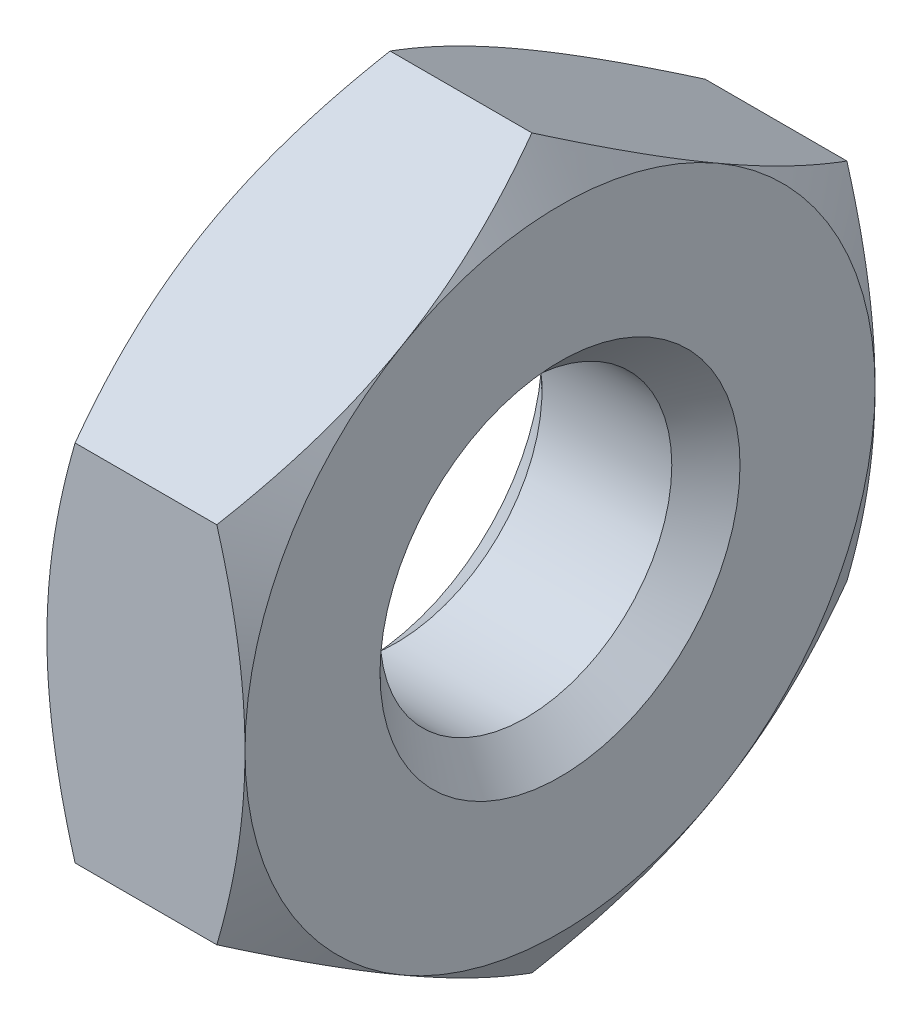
ISO-10303-21;
HEADER;
FILE_DESCRIPTION(('STEP AP214'),'2;1');
FILE_NAME('part.step','',(''),(''),'','','');
FILE_SCHEMA(('AUTOMOTIVE_DESIGN { 1 0 10303 214 1 1 1 1 }'));
ENDSEC;
DATA;
#1=APPLICATION_CONTEXT('core data for automotive mechanical design processes');
#2=APPLICATION_PROTOCOL_DEFINITION('international standard','automotive_design',2000,#1);
#3=PRODUCT_CONTEXT('',#1,'mechanical');
#4=PRODUCT('Part','Part','',(#3));
#5=PRODUCT_RELATED_PRODUCT_CATEGORY('part','',(#4));
#6=PRODUCT_DEFINITION_FORMATION('','',#4);
#7=PRODUCT_DEFINITION_CONTEXT('part definition',#1,'design');
#8=PRODUCT_DEFINITION('design','',#6,#7);
#9=PRODUCT_DEFINITION_SHAPE('','',#8);
#10=(LENGTH_UNIT() NAMED_UNIT(*) SI_UNIT(.MILLI.,.METRE.));
#11=(NAMED_UNIT(*) PLANE_ANGLE_UNIT() SI_UNIT($,.RADIAN.));
#12=(NAMED_UNIT(*) SI_UNIT($,.STERADIAN.) SOLID_ANGLE_UNIT());
#13=UNCERTAINTY_MEASURE_WITH_UNIT(LENGTH_MEASURE(1.E-05),#10,'distance_accuracy_value','');
#14=(GEOMETRIC_REPRESENTATION_CONTEXT(3) GLOBAL_UNCERTAINTY_ASSIGNED_CONTEXT((#13)) GLOBAL_UNIT_ASSIGNED_CONTEXT((#10,
#11,#12)) REPRESENTATION_CONTEXT('',''));
#15=CARTESIAN_POINT('',(0.,0.,0.));
#16=DIRECTION('',(0.,0.,1.));
#17=DIRECTION('',(1.,0.,0.));
#18=AXIS2_PLACEMENT_3D('',#15,#16,#17);
#19=CARTESIAN_POINT('',(1.1,3.5,0.));
#20=DIRECTION('',(-1.,0.,0.));
#21=DIRECTION('',(0.,0.,1.));
#22=AXIS2_PLACEMENT_3D('',#19,#20,#21);
#23=PLANE('',#22);
#24=CARTESIAN_POINT('',(1.10000000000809,0.,0.));
#25=DIRECTION('',(1.,0.,0.));
#26=DIRECTION('',(0.,0.,-1.));
#27=AXIS2_PLACEMENT_3D('',#24,#25,#26);
#28=CIRCLE('',#27,1.99999999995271);
#29=CARTESIAN_POINT('',(1.10000000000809,0.,-1.99999999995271));
#30=VERTEX_POINT('',#29);
#31=EDGE_CURVE('E126',#30,#30,#28,.F.);
#32=ORIENTED_EDGE('',*,*,#31,.T.);
#33=EDGE_LOOP('',(#32));
#34=FACE_BOUND('',#33,.T.);
#35=CARTESIAN_POINT('',(1.0999999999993,0.,0.));
#36=DIRECTION('',(-1.,0.,0.));
#37=DIRECTION('',(0.,0.,1.));
#38=AXIS2_PLACEMENT_3D('',#35,#36,#37);
#39=CIRCLE('',#38,3.50000000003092);
#40=CARTESIAN_POINT('',(1.10000000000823,-3.03108891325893,1.75000000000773));
#41=VERTEX_POINT('',#40);
#42=CARTESIAN_POINT('',(1.10000000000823,0.,3.50000000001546));
#43=VERTEX_POINT('',#42);
#44=EDGE_CURVE('E129',#41,#43,#39,.T.);
#45=ORIENTED_EDGE('',*,*,#44,.F.);
#46=CARTESIAN_POINT('',(1.0999999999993,0.,0.));
#47=DIRECTION('',(-1.,0.,0.));
#48=DIRECTION('',(0.,0.,1.));
#49=AXIS2_PLACEMENT_3D('',#46,#47,#48);
#50=CIRCLE('',#49,3.50000000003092);
#51=CARTESIAN_POINT('',(1.10000000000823,-3.03108891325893,-1.75000000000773));
#52=VERTEX_POINT('',#51);
#53=EDGE_CURVE('E20',#52,#41,#50,.T.);
#54=ORIENTED_EDGE('',*,*,#53,.F.);
#55=CARTESIAN_POINT('',(1.0999999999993,0.,0.));
#56=DIRECTION('',(-1.,0.,0.));
#57=DIRECTION('',(0.,0.,1.));
#58=AXIS2_PLACEMENT_3D('',#55,#56,#57);
#59=CIRCLE('',#58,3.50000000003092);
#60=CARTESIAN_POINT('',(1.10000000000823,0.,-3.50000000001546));
#61=VERTEX_POINT('',#60);
#62=EDGE_CURVE('E104',#61,#52,#59,.T.);
#63=ORIENTED_EDGE('',*,*,#62,.F.);
#64=CARTESIAN_POINT('',(1.0999999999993,0.,0.));
#65=DIRECTION('',(-1.,0.,0.));
#66=DIRECTION('',(0.,0.,1.));
#67=AXIS2_PLACEMENT_3D('',#64,#65,#66);
#68=CIRCLE('',#67,3.50000000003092);
#69=CARTESIAN_POINT('',(1.10000000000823,3.03108891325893,-1.75000000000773));
#70=VERTEX_POINT('',#69);
#71=EDGE_CURVE('E424',#70,#61,#68,.T.);
#72=ORIENTED_EDGE('',*,*,#71,.F.);
#73=CARTESIAN_POINT('',(1.0999999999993,0.,0.));
#74=DIRECTION('',(-1.,0.,0.));
#75=DIRECTION('',(0.,0.,1.));
#76=AXIS2_PLACEMENT_3D('',#73,#74,#75);
#77=CIRCLE('',#76,3.50000000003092);
#78=CARTESIAN_POINT('',(1.10000000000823,3.03108891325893,1.75000000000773));
#79=VERTEX_POINT('',#78);
#80=EDGE_CURVE('E136',#79,#70,#77,.T.);
#81=ORIENTED_EDGE('',*,*,#80,.F.);
#82=CARTESIAN_POINT('',(1.0999999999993,0.,0.));
#83=DIRECTION('',(-1.,0.,0.));
#84=DIRECTION('',(0.,0.,1.));
#85=AXIS2_PLACEMENT_3D('',#82,#83,#84);
#86=CIRCLE('',#85,3.50000000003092);
#87=EDGE_CURVE('E131',#43,#79,#86,.T.);
#88=ORIENTED_EDGE('',*,*,#87,.F.);
#89=EDGE_LOOP('',(#45,#54,#63,#72,#81,#88));
#90=FACE_BOUND('',#89,.T.);
#91=ADVANCED_FACE('F17',(#34,#90),#23,.F.);
#92=CARTESIAN_POINT('',(0.785516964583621,0.,0.));
#93=DIRECTION('',(-1.,0.,0.));
#94=DIRECTION('',(0.,0.,1.));
#95=AXIS2_PLACEMENT_3D('',#92,#93,#94);
#96=CONICAL_SURFACE('',#95,4.04470059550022,1.04719755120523);
#97=ORIENTED_EDGE('',*,*,#53,.T.);
#98=CARTESIAN_POINT('',(0.78739260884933,-4.04145188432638,-6.90409300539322E-12));
#99=CARTESIAN_POINT('',(0.83488760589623,-3.95920876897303,0.142449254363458));
#100=CARTESIAN_POINT('',(0.878401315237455,-3.87630702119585,0.286039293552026));
#101=CARTESIAN_POINT('',(0.955136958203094,-3.70977275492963,0.574485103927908));
#102=CARTESIAN_POINT('',(0.988409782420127,-3.62614604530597,0.719330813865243));
#103=CARTESIAN_POINT('',(1.02926316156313,-3.49991674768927,0.937966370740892));
#104=CARTESIAN_POINT('',(1.04137660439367,-3.45768086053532,1.01112107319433));
#105=CARTESIAN_POINT('',(1.0623452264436,-3.37300688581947,1.15778069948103));
#106=CARTESIAN_POINT('',(1.07120049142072,-3.33056880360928,1.23128561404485));
#107=CARTESIAN_POINT('',(1.08549717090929,-3.24533346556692,1.3789175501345));
#108=CARTESIAN_POINT('',(1.0909212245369,-3.20253547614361,1.45304584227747));
#109=CARTESIAN_POINT('',(1.09818014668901,-3.11685532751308,1.60144821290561));
#110=CARTESIAN_POINT('',(1.10001430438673,-3.07397315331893,1.6757223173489));
#111=CARTESIAN_POINT('',(1.10000000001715,-3.03108891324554,1.75));
#112=B_SPLINE_CURVE_WITH_KNOTS('',3,(#98,#99,#100,#101,#102,#103,#104,#105,#106,#107,#108,#109,
#110,#111),.UNSPECIFIED.,.F.,.F.,(4,2,2,2,2,2,4),(0.,0.513825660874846,1.02505510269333,
1.28100524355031,1.53694864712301,1.79417690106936,2.05145608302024),.UNSPECIFIED.);
#113=CARTESIAN_POINT('',(0.787392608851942,-4.0414518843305,0.));
#114=VERTEX_POINT('',#113);
#115=EDGE_CURVE('E113',#114,#41,#112,.T.);
#116=ORIENTED_EDGE('',*,*,#115,.F.);
#117=CARTESIAN_POINT('',(1.10000000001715,-3.03108891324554,-1.75));
#118=CARTESIAN_POINT('',(1.10001430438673,-3.07397315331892,-1.67572231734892));
#119=CARTESIAN_POINT('',(1.09818014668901,-3.11685532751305,-1.60144821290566));
#120=CARTESIAN_POINT('',(1.09092122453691,-3.20253547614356,-1.45304584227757));
#121=CARTESIAN_POINT('',(1.0854971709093,-3.24533346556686,-1.37891755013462));
#122=CARTESIAN_POINT('',(1.07120049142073,-3.33056880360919,-1.231285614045));
#123=CARTESIAN_POINT('',(1.06234522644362,-3.37300688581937,-1.15778069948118));
#124=CARTESIAN_POINT('',(1.0413766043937,-3.45768086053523,-1.01112107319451));
#125=CARTESIAN_POINT('',(1.02926316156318,-3.4999167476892,-0.937966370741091));
#126=CARTESIAN_POINT('',(0.988409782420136,-3.62614604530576,-0.719330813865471));
#127=CARTESIAN_POINT('',(0.955136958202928,-3.70977275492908,-0.574485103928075));
#128=CARTESIAN_POINT('',(0.878401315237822,-3.87630702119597,-0.286039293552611));
#129=CARTESIAN_POINT('',(0.834887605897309,-3.95920876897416,-0.142449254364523));
#130=CARTESIAN_POINT('',(0.787392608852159,-4.04145188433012,4.74310589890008E-12));
#131=B_SPLINE_CURVE_WITH_KNOTS('',3,(#117,#118,#119,#120,#121,#122,#123,#124,#125,#126,#127,
#128,#129,#130),.UNSPECIFIED.,.F.,.F.,(4,2,2,2,2,2,4),(0.,0.257279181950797,0.514507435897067,
0.770450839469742,1.02640098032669,1.53763042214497,2.05145608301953),.UNSPECIFIED.);
#132=EDGE_CURVE('E115',#52,#114,#131,.T.);
#133=ORIENTED_EDGE('',*,*,#132,.F.);
#134=EDGE_LOOP('',(#97,#116,#133));
#135=FACE_BOUND('',#134,.T.);
#136=ADVANCED_FACE('F112',(#135),#96,.T.);
#137=CARTESIAN_POINT('',(0.785516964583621,0.,0.));
#138=DIRECTION('',(-1.,0.,0.));
#139=DIRECTION('',(0.,0.,1.));
#140=AXIS2_PLACEMENT_3D('',#137,#138,#139);
#141=CONICAL_SURFACE('',#140,4.04470059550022,1.04719755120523);
#142=ORIENTED_EDGE('',*,*,#62,.T.);
#143=CARTESIAN_POINT('',(0.787392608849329,-2.02072594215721,-3.50000000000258));
#144=CARTESIAN_POINT('',(0.834887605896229,-2.10296905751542,-3.35755074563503));
#145=CARTESIAN_POINT('',(0.878401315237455,-2.18587080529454,-3.21396070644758));
#146=CARTESIAN_POINT('',(0.955136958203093,-2.35240507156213,-2.92551489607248));
#147=CARTESIAN_POINT('',(0.988409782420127,-2.43603178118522,-2.78066918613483));
#148=CARTESIAN_POINT('',(1.02926316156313,-2.56226107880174,-2.56203362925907));
#149=CARTESIAN_POINT('',(1.04137660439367,-2.60449696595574,-2.48887892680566));
#150=CARTESIAN_POINT('',(1.0623452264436,-2.68917094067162,-2.34221930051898));
#151=CARTESIAN_POINT('',(1.07120049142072,-2.7316090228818,-2.26871438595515));
#152=CARTESIAN_POINT('',(1.08549717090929,-2.81684436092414,-2.12108244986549));
#153=CARTESIAN_POINT('',(1.0909212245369,-2.85964235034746,-2.04695415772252));
#154=CARTESIAN_POINT('',(1.09818014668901,-2.94532249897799,-1.89855178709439));
#155=CARTESIAN_POINT('',(1.10001430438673,-2.98820467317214,-1.8242776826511));
#156=CARTESIAN_POINT('',(1.10000000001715,-3.03108891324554,-1.75));
#157=B_SPLINE_CURVE_WITH_KNOTS('',3,(#143,#144,#145,#146,#147,#148,#149,#150,#151,#152,#153,
#154,#155,#156),.UNSPECIFIED.,.F.,.F.,(4,2,2,2,2,2,4),(0.,0.513825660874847,1.02505510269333,
1.28100524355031,1.53694864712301,1.79417690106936,2.05145608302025),.UNSPECIFIED.);
#158=CARTESIAN_POINT('',(0.787392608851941,-2.02072594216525,-3.5000000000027));
#159=VERTEX_POINT('',#158);
#160=EDGE_CURVE('E140',#159,#52,#157,.T.);
#161=ORIENTED_EDGE('',*,*,#160,.F.);
#162=CARTESIAN_POINT('',(1.10000000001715,0.,-3.5));
#163=CARTESIAN_POINT('',(1.10001430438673,-0.085768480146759,-3.5));
#164=CARTESIAN_POINT('',(1.09818014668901,-0.171532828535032,-3.5));
#165=CARTESIAN_POINT('',(1.09092122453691,-0.342893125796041,-3.5));
#166=CARTESIAN_POINT('',(1.0854971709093,-0.42848910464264,-3.5));
#167=CARTESIAN_POINT('',(1.07120049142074,-0.598959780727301,-3.5));
#168=CARTESIAN_POINT('',(1.06234522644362,-0.683835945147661,-3.5));
#169=CARTESIAN_POINT('',(1.0413766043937,-0.853183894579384,-3.5));
#170=CARTESIAN_POINT('',(1.02926316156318,-0.93765566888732,-3.5));
#171=CARTESIAN_POINT('',(0.988409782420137,-1.19011426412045,-3.5));
#172=CARTESIAN_POINT('',(0.955136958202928,-1.35736768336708,-3.5));
#173=CARTESIAN_POINT('',(0.878401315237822,-1.69043621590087,-3.5));
#174=CARTESIAN_POINT('',(0.834887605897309,-1.85623971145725,-3.5));
#175=CARTESIAN_POINT('',(0.787392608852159,-2.02072594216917,-3.5));
#176=B_SPLINE_CURVE_WITH_KNOTS('',3,(#162,#163,#164,#165,#166,#167,#168,#169,#170,#171,#172,
#173,#174,#175),.UNSPECIFIED.,.F.,.F.,(4,2,2,2,2,2,4),(0.,0.257279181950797,0.514507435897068,
0.770450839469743,1.02640098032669,1.53763042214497,2.05145608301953),.UNSPECIFIED.);
#177=EDGE_CURVE('E294',#61,#159,#176,.T.);
#178=ORIENTED_EDGE('',*,*,#177,.F.);
#179=EDGE_LOOP('',(#142,#161,#178));
#180=FACE_BOUND('',#179,.T.);
#181=ADVANCED_FACE('F284',(#180),#141,.T.);
#182=CARTESIAN_POINT('',(0.785516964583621,0.,0.));
#183=DIRECTION('',(-1.,0.,0.));
#184=DIRECTION('',(0.,0.,1.));
#185=AXIS2_PLACEMENT_3D('',#182,#183,#184);
#186=CONICAL_SURFACE('',#185,4.04470059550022,1.04719755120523);
#187=ORIENTED_EDGE('',*,*,#71,.T.);
#188=CARTESIAN_POINT('',(0.78739260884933,2.02072594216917,-3.49999999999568));
#189=CARTESIAN_POINT('',(0.83488760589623,1.85623971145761,-3.49999999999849));
#190=CARTESIAN_POINT('',(0.878401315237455,1.69043621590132,-3.49999999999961));
#191=CARTESIAN_POINT('',(0.955136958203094,1.3573676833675,-3.50000000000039));
#192=CARTESIAN_POINT('',(0.988409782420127,1.19011426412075,-3.50000000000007));
#193=CARTESIAN_POINT('',(1.02926316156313,0.937655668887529,-3.49999999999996));
#194=CARTESIAN_POINT('',(1.04137660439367,0.853183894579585,-3.49999999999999));
#195=CARTESIAN_POINT('',(1.0623452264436,0.683835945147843,-3.50000000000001));
#196=CARTESIAN_POINT('',(1.07120049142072,0.598959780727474,-3.5));
#197=CARTESIAN_POINT('',(1.08549717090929,0.428489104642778,-3.5));
#198=CARTESIAN_POINT('',(1.0909212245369,0.342893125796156,-3.5));
#199=CARTESIAN_POINT('',(1.09818014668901,0.171532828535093,-3.5));
#200=CARTESIAN_POINT('',(1.10001430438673,0.0857684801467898,-3.5));
#201=CARTESIAN_POINT('',(1.10000000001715,0.,-3.5));
#202=B_SPLINE_CURVE_WITH_KNOTS('',3,(#188,#189,#190,#191,#192,#193,#194,#195,#196,#197,#198,
#199,#200,#201),.UNSPECIFIED.,.F.,.F.,(4,2,2,2,2,2,4),(0.,0.513825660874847,1.02505510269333,
1.28100524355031,1.53694864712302,1.79417690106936,2.05145608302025),.UNSPECIFIED.);
#203=CARTESIAN_POINT('',(0.787392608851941,2.02072594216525,-3.5000000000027));
#204=VERTEX_POINT('',#203);
#205=EDGE_CURVE('E289',#204,#61,#202,.T.);
#206=ORIENTED_EDGE('',*,*,#205,.F.);
#207=CARTESIAN_POINT('',(1.10000000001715,3.03108891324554,-1.75));
#208=CARTESIAN_POINT('',(1.10001430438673,2.98820467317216,-1.82427768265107));
#209=CARTESIAN_POINT('',(1.09818014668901,2.94532249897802,-1.89855178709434));
#210=CARTESIAN_POINT('',(1.09092122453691,2.85964235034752,-2.04695415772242));
#211=CARTESIAN_POINT('',(1.0854971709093,2.81684436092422,-2.12108244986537));
#212=CARTESIAN_POINT('',(1.07120049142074,2.73160902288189,-2.268714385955));
#213=CARTESIAN_POINT('',(1.06234522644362,2.68917094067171,-2.34221930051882));
#214=CARTESIAN_POINT('',(1.0413766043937,2.60449696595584,-2.48887892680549));
#215=CARTESIAN_POINT('',(1.02926316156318,2.56226107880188,-2.56203362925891));
#216=CARTESIAN_POINT('',(0.988409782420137,2.43603178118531,-2.78066918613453));
#217=CARTESIAN_POINT('',(0.955136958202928,2.35240507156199,-2.92551489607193));
#218=CARTESIAN_POINT('',(0.878401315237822,2.1858708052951,-3.21396070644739));
#219=CARTESIAN_POINT('',(0.834887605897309,2.10296905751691,-3.35755074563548));
#220=CARTESIAN_POINT('',(0.787392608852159,2.02072594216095,-3.50000000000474));
#221=B_SPLINE_CURVE_WITH_KNOTS('',3,(#207,#208,#209,#210,#211,#212,#213,#214,#215,#216,#217,
#218,#219,#220),.UNSPECIFIED.,.F.,.F.,(4,2,2,2,2,2,4),(0.,0.257279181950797,0.514507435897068,
0.770450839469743,1.02640098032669,1.53763042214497,2.05145608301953),.UNSPECIFIED.);
#222=EDGE_CURVE('E267',#70,#204,#221,.T.);
#223=ORIENTED_EDGE('',*,*,#222,.F.);
#224=EDGE_LOOP('',(#187,#206,#223));
#225=FACE_BOUND('',#224,.T.);
#226=ADVANCED_FACE('F281',(#225),#186,.T.);
#227=CARTESIAN_POINT('',(0.785516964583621,0.,0.));
#228=DIRECTION('',(-1.,0.,0.));
#229=DIRECTION('',(0.,0.,1.));
#230=AXIS2_PLACEMENT_3D('',#227,#228,#229);
#231=CONICAL_SURFACE('',#230,4.04470059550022,1.04719755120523);
#232=ORIENTED_EDGE('',*,*,#80,.T.);
#233=CARTESIAN_POINT('',(0.78739260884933,4.04145188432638,6.9039906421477E-12));
#234=CARTESIAN_POINT('',(0.83488760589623,3.95920876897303,-0.142449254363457));
#235=CARTESIAN_POINT('',(0.878401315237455,3.87630702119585,-0.286039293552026));
#236=CARTESIAN_POINT('',(0.955136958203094,3.70977275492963,-0.574485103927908));
#237=CARTESIAN_POINT('',(0.988409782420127,3.62614604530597,-0.719330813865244));
#238=CARTESIAN_POINT('',(1.02926316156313,3.49991674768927,-0.937966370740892));
#239=CARTESIAN_POINT('',(1.04137660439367,3.45768086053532,-1.01112107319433));
#240=CARTESIAN_POINT('',(1.0623452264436,3.37300688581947,-1.15778069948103));
#241=CARTESIAN_POINT('',(1.07120049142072,3.33056880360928,-1.23128561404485));
#242=CARTESIAN_POINT('',(1.08549717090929,3.24533346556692,-1.3789175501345));
#243=CARTESIAN_POINT('',(1.0909212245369,3.20253547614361,-1.45304584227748));
#244=CARTESIAN_POINT('',(1.09818014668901,3.11685532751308,-1.60144821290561));
#245=CARTESIAN_POINT('',(1.10001430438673,3.07397315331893,-1.6757223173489));
#246=CARTESIAN_POINT('',(1.10000000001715,3.03108891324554,-1.75));
#247=B_SPLINE_CURVE_WITH_KNOTS('',3,(#233,#234,#235,#236,#237,#238,#239,#240,#241,#242,#243,
#244,#245,#246),.UNSPECIFIED.,.F.,.F.,(4,2,2,2,2,2,4),(0.,0.513825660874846,1.02505510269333,
1.28100524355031,1.53694864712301,1.79417690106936,2.05145608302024),.UNSPECIFIED.);
#248=CARTESIAN_POINT('',(0.787392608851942,4.0414518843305,0.));
#249=VERTEX_POINT('',#248);
#250=EDGE_CURVE('E272',#249,#70,#247,.T.);
#251=ORIENTED_EDGE('',*,*,#250,.F.);
#252=CARTESIAN_POINT('',(1.10000000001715,3.03108891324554,1.75));
#253=CARTESIAN_POINT('',(1.10001430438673,3.07397315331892,1.67572231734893));
#254=CARTESIAN_POINT('',(1.09818014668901,3.11685532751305,1.60144821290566));
#255=CARTESIAN_POINT('',(1.09092122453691,3.20253547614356,1.45304584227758));
#256=CARTESIAN_POINT('',(1.0854971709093,3.24533346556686,1.37891755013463));
#257=CARTESIAN_POINT('',(1.07120049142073,3.33056880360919,1.231285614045));
#258=CARTESIAN_POINT('',(1.06234522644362,3.37300688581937,1.15778069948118));
#259=CARTESIAN_POINT('',(1.0413766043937,3.45768086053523,1.01112107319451));
#260=CARTESIAN_POINT('',(1.02926316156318,3.4999167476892,0.937966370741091));
#261=CARTESIAN_POINT('',(0.988409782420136,3.62614604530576,0.719330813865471));
#262=CARTESIAN_POINT('',(0.955136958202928,3.70977275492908,0.574485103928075));
#263=CARTESIAN_POINT('',(0.878401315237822,3.87630702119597,0.286039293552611));
#264=CARTESIAN_POINT('',(0.834887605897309,3.95920876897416,0.142449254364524));
#265=CARTESIAN_POINT('',(0.787392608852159,4.04145188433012,-4.74302297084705E-12));
#266=B_SPLINE_CURVE_WITH_KNOTS('',3,(#252,#253,#254,#255,#256,#257,#258,#259,#260,#261,#262,
#263,#264,#265),.UNSPECIFIED.,.F.,.F.,(4,2,2,2,2,2,4),(0.,0.257279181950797,0.514507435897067,
0.770450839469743,1.02640098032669,1.53763042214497,2.05145608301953),.UNSPECIFIED.);
#267=EDGE_CURVE('E183',#79,#249,#266,.T.);
#268=ORIENTED_EDGE('',*,*,#267,.F.);
#269=EDGE_LOOP('',(#232,#251,#268));
#270=FACE_BOUND('',#269,.T.);
#271=ADVANCED_FACE('F165',(#270),#231,.T.);
#272=CARTESIAN_POINT('',(0.785516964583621,0.,0.));
#273=DIRECTION('',(-1.,0.,0.));
#274=DIRECTION('',(0.,0.,1.));
#275=AXIS2_PLACEMENT_3D('',#272,#273,#274);
#276=CONICAL_SURFACE('',#275,4.04470059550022,1.04719755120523);
#277=ORIENTED_EDGE('',*,*,#44,.T.);
#278=CARTESIAN_POINT('',(0.78739260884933,-2.02072594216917,3.49999999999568));
#279=CARTESIAN_POINT('',(0.834887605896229,-1.85623971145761,3.49999999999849));
#280=CARTESIAN_POINT('',(0.878401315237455,-1.69043621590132,3.49999999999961));
#281=CARTESIAN_POINT('',(0.955136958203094,-1.3573676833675,3.50000000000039));
#282=CARTESIAN_POINT('',(0.988409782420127,-1.19011426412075,3.50000000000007));
#283=CARTESIAN_POINT('',(1.02926316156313,-0.937655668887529,3.49999999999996));
#284=CARTESIAN_POINT('',(1.04137660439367,-0.853183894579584,3.49999999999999));
#285=CARTESIAN_POINT('',(1.0623452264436,-0.683835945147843,3.50000000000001));
#286=CARTESIAN_POINT('',(1.07120049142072,-0.598959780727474,3.5));
#287=CARTESIAN_POINT('',(1.08549717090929,-0.428489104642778,3.5));
#288=CARTESIAN_POINT('',(1.0909212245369,-0.342893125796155,3.5));
#289=CARTESIAN_POINT('',(1.09818014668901,-0.171532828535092,3.5));
#290=CARTESIAN_POINT('',(1.10001430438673,-0.085768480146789,3.5));
#291=CARTESIAN_POINT('',(1.10000000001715,0.,3.5));
#292=B_SPLINE_CURVE_WITH_KNOTS('',3,(#278,#279,#280,#281,#282,#283,#284,#285,#286,#287,#288,
#289,#290,#291),.UNSPECIFIED.,.F.,.F.,(4,2,2,2,2,2,4),(0.,0.513825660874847,1.02505510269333,
1.28100524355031,1.53694864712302,1.79417690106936,2.05145608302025),.UNSPECIFIED.);
#293=CARTESIAN_POINT('',(0.787392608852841,-2.02072594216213,3.5000000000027));
#294=VERTEX_POINT('',#293);
#295=EDGE_CURVE('E139',#294,#43,#292,.T.);
#296=ORIENTED_EDGE('',*,*,#295,.F.);
#297=CARTESIAN_POINT('',(1.10000000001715,-3.03108891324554,1.75));
#298=CARTESIAN_POINT('',(1.10001430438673,-2.98820467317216,1.82427768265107));
#299=CARTESIAN_POINT('',(1.09818014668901,-2.94532249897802,1.89855178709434));
#300=CARTESIAN_POINT('',(1.09092122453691,-2.85964235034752,2.04695415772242));
#301=CARTESIAN_POINT('',(1.0854971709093,-2.81684436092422,2.12108244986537));
#302=CARTESIAN_POINT('',(1.07120049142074,-2.73160902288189,2.268714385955));
#303=CARTESIAN_POINT('',(1.06234522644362,-2.68917094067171,2.34221930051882));
#304=CARTESIAN_POINT('',(1.0413766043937,-2.60449696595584,2.48887892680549));
#305=CARTESIAN_POINT('',(1.02926316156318,-2.56226107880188,2.56203362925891));
#306=CARTESIAN_POINT('',(0.988409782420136,-2.43603178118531,2.78066918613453));
#307=CARTESIAN_POINT('',(0.955136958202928,-2.352405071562,2.92551489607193));
#308=CARTESIAN_POINT('',(0.878401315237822,-2.1858708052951,3.21396070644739));
#309=CARTESIAN_POINT('',(0.83488760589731,-2.10296905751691,3.35755074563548));
#310=CARTESIAN_POINT('',(0.787392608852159,-2.02072594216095,3.50000000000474));
#311=B_SPLINE_CURVE_WITH_KNOTS('',3,(#297,#298,#299,#300,#301,#302,#303,#304,#305,#306,#307,
#308,#309,#310),.UNSPECIFIED.,.F.,.F.,(4,2,2,2,2,2,4),(0.,0.257279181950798,0.514507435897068,
0.770450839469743,1.02640098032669,1.53763042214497,2.05145608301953),.UNSPECIFIED.);
#312=EDGE_CURVE('E122',#41,#294,#311,.T.);
#313=ORIENTED_EDGE('',*,*,#312,.F.);
#314=EDGE_LOOP('',(#277,#296,#313));
#315=FACE_BOUND('',#314,.T.);
#316=ADVANCED_FACE('F138',(#315),#276,.T.);
#317=CARTESIAN_POINT('',(0.785516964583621,0.,0.));
#318=DIRECTION('',(-1.,0.,0.));
#319=DIRECTION('',(0.,0.,1.));
#320=AXIS2_PLACEMENT_3D('',#317,#318,#319);
#321=CONICAL_SURFACE('',#320,4.04470059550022,1.04719755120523);
#322=CARTESIAN_POINT('',(1.10000000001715,0.,3.5));
#323=CARTESIAN_POINT('',(1.10001430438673,0.0857684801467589,3.5));
#324=CARTESIAN_POINT('',(1.09818014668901,0.171532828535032,3.5));
#325=CARTESIAN_POINT('',(1.09092122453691,0.342893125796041,3.5));
#326=CARTESIAN_POINT('',(1.0854971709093,0.428489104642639,3.5));
#327=CARTESIAN_POINT('',(1.07120049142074,0.598959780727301,3.5));
#328=CARTESIAN_POINT('',(1.06234522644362,0.683835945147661,3.5));
#329=CARTESIAN_POINT('',(1.0413766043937,0.853183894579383,3.5));
#330=CARTESIAN_POINT('',(1.02926316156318,0.93765566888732,3.5));
#331=CARTESIAN_POINT('',(0.988409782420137,1.19011426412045,3.5));
#332=CARTESIAN_POINT('',(0.955136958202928,1.35736768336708,3.5));
#333=CARTESIAN_POINT('',(0.878401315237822,1.69043621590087,3.5));
#334=CARTESIAN_POINT('',(0.834887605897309,1.85623971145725,3.5));
#335=CARTESIAN_POINT('',(0.787392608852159,2.02072594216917,3.5));
#336=B_SPLINE_CURVE_WITH_KNOTS('',3,(#322,#323,#324,#325,#326,#327,#328,#329,#330,#331,#332,
#333,#334,#335),.UNSPECIFIED.,.F.,.F.,(4,2,2,2,2,2,4),(0.,0.257279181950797,0.514507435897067,
0.770450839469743,1.02640098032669,1.53763042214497,2.05145608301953),.UNSPECIFIED.);
#337=CARTESIAN_POINT('',(0.787392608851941,2.02072594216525,3.5000000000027));
#338=VERTEX_POINT('',#337);
#339=EDGE_CURVE('E177',#43,#338,#336,.T.);
#340=ORIENTED_EDGE('',*,*,#339,.F.);
#341=ORIENTED_EDGE('',*,*,#87,.T.);
#342=CARTESIAN_POINT('',(0.787392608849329,2.02072594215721,3.50000000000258));
#343=CARTESIAN_POINT('',(0.834887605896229,2.10296905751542,3.35755074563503));
#344=CARTESIAN_POINT('',(0.878401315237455,2.18587080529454,3.21396070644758));
#345=CARTESIAN_POINT('',(0.955136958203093,2.35240507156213,2.92551489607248));
#346=CARTESIAN_POINT('',(0.988409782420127,2.43603178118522,2.78066918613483));
#347=CARTESIAN_POINT('',(1.02926316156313,2.56226107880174,2.56203362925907));
#348=CARTESIAN_POINT('',(1.04137660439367,2.60449696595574,2.48887892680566));
#349=CARTESIAN_POINT('',(1.0623452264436,2.68917094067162,2.34221930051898));
#350=CARTESIAN_POINT('',(1.07120049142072,2.7316090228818,2.26871438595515));
#351=CARTESIAN_POINT('',(1.08549717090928,2.81684436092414,2.12108244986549));
#352=CARTESIAN_POINT('',(1.0909212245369,2.85964235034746,2.04695415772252));
#353=CARTESIAN_POINT('',(1.09818014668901,2.94532249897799,1.89855178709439));
#354=CARTESIAN_POINT('',(1.10001430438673,2.98820467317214,1.8242776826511));
#355=CARTESIAN_POINT('',(1.10000000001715,3.03108891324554,1.75));
#356=B_SPLINE_CURVE_WITH_KNOTS('',3,(#342,#343,#344,#345,#346,#347,#348,#349,#350,#351,#352,
#353,#354,#355),.UNSPECIFIED.,.F.,.F.,(4,2,2,2,2,2,4),(0.,0.513825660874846,1.02505510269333,
1.28100524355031,1.53694864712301,1.79417690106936,2.05145608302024),.UNSPECIFIED.);
#357=EDGE_CURVE('E273',#338,#79,#356,.T.);
#358=ORIENTED_EDGE('',*,*,#357,.F.);
#359=EDGE_LOOP('',(#340,#341,#358));
#360=FACE_BOUND('',#359,.T.);
#361=ADVANCED_FACE('F164',(#360),#321,.T.);
#362=CARTESIAN_POINT('',(1.10000000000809,0.,0.));
#363=DIRECTION('',(1.,0.,0.));
#364=DIRECTION('',(0.,0.,-1.));
#365=AXIS2_PLACEMENT_3D('',#362,#363,#364);
#366=CONICAL_SURFACE('',#365,1.99999999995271,0.785398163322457);
#367=CARTESIAN_POINT('',(0.721,0.,0.));
#368=DIRECTION('',(-1.,0.,0.));
#369=DIRECTION('',(0.,0.,1.));
#370=AXIS2_PLACEMENT_3D('',#367,#368,#369);
#371=CIRCLE('',#370,1.621);
#372=CARTESIAN_POINT('',(0.721,0.,1.621));
#373=VERTEX_POINT('',#372);
#374=EDGE_CURVE('E358',#373,#373,#371,.T.);
#375=ORIENTED_EDGE('',*,*,#374,.T.);
#376=EDGE_LOOP('',(#375));
#377=FACE_BOUND('',#376,.T.);
#378=ORIENTED_EDGE('',*,*,#31,.F.);
#379=EDGE_LOOP('',(#378));
#380=FACE_BOUND('',#379,.T.);
#381=ADVANCED_FACE('F436',(#377,#380),#366,.F.);
#382=CARTESIAN_POINT('',(-1.1,-2.02072594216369,3.5));
#383=DIRECTION('',(0.,-0.866025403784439,0.5));
#384=DIRECTION('',(0.,-0.5,-0.866025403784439));
#385=AXIS2_PLACEMENT_3D('',#382,#383,#384);
#386=PLANE('',#385);
#387=ORIENTED_EDGE('',*,*,#312,.T.);
#388=DIRECTION('',(1.,0.,0.));
#389=VECTOR('',#388,1.);
#390=CARTESIAN_POINT('',(-1.1,-2.02072594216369,3.5));
#391=LINE('',#390,#389);
#392=CARTESIAN_POINT('',(-0.787392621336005,-2.02072596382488,3.49999996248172));
#393=VERTEX_POINT('',#392);
#394=EDGE_CURVE('E178',#393,#294,#391,.T.);
#395=ORIENTED_EDGE('',*,*,#394,.F.);
#396=CARTESIAN_POINT('',(-1.10000000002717,-3.03108891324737,1.75000000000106));
#397=CARTESIAN_POINT('',(-1.10001430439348,-2.98820467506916,1.82427767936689));
#398=CARTESIAN_POINT('',(-1.09818014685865,-2.94532250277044,1.89855178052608));
#399=CARTESIAN_POINT('',(-1.0909212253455,-2.85964235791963,2.04695414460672));
#400=CARTESIAN_POINT('',(-1.08549717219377,-2.81684437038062,2.12108243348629));
#401=CARTESIAN_POINT('',(-1.07120049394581,-2.73160903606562,2.26871436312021));
#402=CARTESIAN_POINT('',(-1.06234522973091,-2.68917095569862,2.34221927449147));
#403=CARTESIAN_POINT('',(-1.04137660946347,-2.60449698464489,2.48887889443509));
#404=CARTESIAN_POINT('',(-1.02926316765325,-2.56226109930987,2.56203359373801));
#405=CARTESIAN_POINT('',(-0.988409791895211,-2.43603180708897,2.78066914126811));
#406=CARTESIAN_POINT('',(-0.955136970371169,-2.35240510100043,2.92551484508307));
#407=CARTESIAN_POINT('',(-0.878401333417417,-2.18587084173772,3.21396064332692));
#408=CARTESIAN_POINT('',(-0.834887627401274,-2.10296909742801,3.3575506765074));
#409=CARTESIAN_POINT('',(-0.787392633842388,-2.02072598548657,3.49999992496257));
#410=B_SPLINE_CURVE_WITH_KNOTS('',3,(#396,#397,#398,#399,#400,#401,#402,#403,#404,#405,#406,
#407,#408,#409),.UNSPECIFIED.,.F.,.F.,(4,2,2,2,2,2,4),(0.,0.257279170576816,0.514507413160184,
0.77045080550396,1.02640093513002,1.53763035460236,2.05145599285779),.UNSPECIFIED.);
#411=CARTESIAN_POINT('',(-1.10000000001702,-3.03108891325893,1.75000000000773));
#412=VERTEX_POINT('',#411);
#413=EDGE_CURVE('E367',#412,#393,#410,.T.);
#414=ORIENTED_EDGE('',*,*,#413,.F.);
#415=CARTESIAN_POINT('',(-0.787392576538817,-4.04145186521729,-4.19402558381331E-08));
#416=CARTESIAN_POINT('',(-0.83488758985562,-3.9592087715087,0.142449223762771));
#417=CARTESIAN_POINT('',(-0.878401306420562,-3.87630703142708,0.286039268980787));
#418=CARTESIAN_POINT('',(-0.955136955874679,-3.70977276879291,0.574485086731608));
#419=CARTESIAN_POINT('',(-0.988409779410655,-3.62614605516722,0.719330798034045));
#420=CARTESIAN_POINT('',(-1.02926315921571,-3.49991675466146,0.937966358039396));
#421=CARTESIAN_POINT('',(-1.0413766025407,-3.45768086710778,1.01112106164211));
#422=CARTESIAN_POINT('',(-1.06234522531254,-3.3730068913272,1.15778069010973));
#423=CARTESIAN_POINT('',(-1.07120049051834,-3.33056880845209,1.23128560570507));
#424=CARTESIAN_POINT('',(-1.08549717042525,-3.24533346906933,1.3789175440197));
#425=CARTESIAN_POINT('',(-1.09092122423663,-3.20253547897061,1.45304583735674));
#426=CARTESIAN_POINT('',(-1.09818014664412,-3.11685532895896,1.60144821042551));
#427=CARTESIAN_POINT('',(-1.10001430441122,-3.07397315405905,1.67572231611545));
#428=CARTESIAN_POINT('',(-1.10000000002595,-3.03108891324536,1.7500000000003));
#429=B_SPLINE_CURVE_WITH_KNOTS('',3,(#415,#416,#417,#418,#419,#420,#421,#422,#423,#424,#425,
#426,#427,#428),.UNSPECIFIED.,.F.,.F.,(4,2,2,2,2,2,4),(0.,0.513825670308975,1.0250551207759,
1.28100526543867,1.5369486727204,1.79417693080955,2.05145611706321),.UNSPECIFIED.);
#430=CARTESIAN_POINT('',(-0.787392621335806,-4.04145186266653,-3.75176855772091E-08));
#431=VERTEX_POINT('',#430);
#432=EDGE_CURVE('E403',#431,#412,#429,.T.);
#433=ORIENTED_EDGE('',*,*,#432,.F.);
#434=DIRECTION('',(1.,0.,0.));
#435=VECTOR('',#434,1.);
#436=CARTESIAN_POINT('',(-1.1,-4.04145188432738,0.));
#437=LINE('',#436,#435);
#438=EDGE_CURVE('E125',#114,#431,#437,.F.);
#439=ORIENTED_EDGE('',*,*,#438,.F.);
#440=ORIENTED_EDGE('',*,*,#115,.T.);
#441=EDGE_LOOP('',(#387,#395,#414,#433,#439,#440));
#442=FACE_BOUND('',#441,.T.);
#443=ADVANCED_FACE('F119',(#442),#386,.T.);
#444=CARTESIAN_POINT('',(-1.1,-4.04145188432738,0.));
#445=DIRECTION('',(0.,-0.866025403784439,-0.5));
#446=DIRECTION('',(0.,0.5,-0.866025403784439));
#447=AXIS2_PLACEMENT_3D('',#444,#445,#446);
#448=PLANE('',#447);
#449=ORIENTED_EDGE('',*,*,#132,.T.);
#450=ORIENTED_EDGE('',*,*,#438,.T.);
#451=CARTESIAN_POINT('',(-1.10000000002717,-3.03108891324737,-1.75000000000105));
#452=CARTESIAN_POINT('',(-1.10001430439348,-3.07397315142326,-1.67572232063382));
#453=CARTESIAN_POINT('',(-1.09818014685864,-3.11685532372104,-1.60144821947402));
#454=CARTESIAN_POINT('',(-1.09092122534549,-3.2025354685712,-1.45304585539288));
#455=CARTESIAN_POINT('',(-1.08549717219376,-3.2453334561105,-1.37891756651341));
#456=CARTESIAN_POINT('',(-1.07120049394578,-3.33056879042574,-1.2312856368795));
#457=CARTESIAN_POINT('',(-1.06234522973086,-3.3730068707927,-1.15778072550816));
#458=CARTESIAN_POINT('',(-1.0413766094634,-3.45768084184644,-1.01112110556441));
#459=CARTESIAN_POINT('',(-1.02926316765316,-3.4999167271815,-0.937966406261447));
#460=CARTESIAN_POINT('',(-0.988409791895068,-3.62614601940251,-0.719330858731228));
#461=CARTESIAN_POINT('',(-0.955136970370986,-3.70977272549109,-0.574485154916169));
#462=CARTESIAN_POINT('',(-0.878401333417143,-3.87630698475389,-0.286039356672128));
#463=CARTESIAN_POINT('',(-0.834887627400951,-3.95920872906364,-0.142449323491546));
#464=CARTESIAN_POINT('',(-0.787392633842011,-4.04145184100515,-7.50363026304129E-08));
#465=B_SPLINE_CURVE_WITH_KNOTS('',3,(#451,#452,#453,#454,#455,#456,#457,#458,#459,#460,#461,
#462,#463,#464),.UNSPECIFIED.,.F.,.F.,(4,2,2,2,2,2,4),(0.,0.257279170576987,0.514507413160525,
0.77045080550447,1.0264009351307,1.53763035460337,2.05145599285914),.UNSPECIFIED.);
#466=CARTESIAN_POINT('',(-1.10000000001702,-3.03108891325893,-1.75000000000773));
#467=VERTEX_POINT('',#466);
#468=EDGE_CURVE('E407',#467,#431,#465,.T.);
#469=ORIENTED_EDGE('',*,*,#468,.F.);
#470=CARTESIAN_POINT('',(-0.787392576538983,-2.02072589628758,-3.50000000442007));
#471=CARTESIAN_POINT('',(-0.834887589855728,-2.10296903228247,-3.35755076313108));
#472=CARTESIAN_POINT('',(-0.878401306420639,-2.18587078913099,-3.21396072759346));
#473=CARTESIAN_POINT('',(-0.95513695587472,-2.35240506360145,-2.92551491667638));
#474=CARTESIAN_POINT('',(-0.988409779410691,-2.43603177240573,-2.78066920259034));
#475=CARTESIAN_POINT('',(-1.02926315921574,-2.5622610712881,-2.56203364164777));
#476=CARTESIAN_POINT('',(-1.04137660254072,-2.60449695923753,-2.48887893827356));
#477=CARTESIAN_POINT('',(-1.06234522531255,-2.68917093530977,-2.34221930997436));
#478=CARTESIAN_POINT('',(-1.07120049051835,-2.73160901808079,-2.26871439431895));
#479=CARTESIAN_POINT('',(-1.08549717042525,-2.81684435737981,-2.121082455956));
#480=CARTESIAN_POINT('',(-1.09092122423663,-2.85964234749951,-2.04695416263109));
#481=CARTESIAN_POINT('',(-1.09818014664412,-2.94532249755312,-1.89855178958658));
#482=CARTESIAN_POINT('',(-1.10001430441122,-2.98820467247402,-1.82427768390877));
#483=CARTESIAN_POINT('',(-1.10000000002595,-3.03108891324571,-1.74999999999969));
#484=B_SPLINE_CURVE_WITH_KNOTS('',3,(#470,#471,#472,#473,#474,#475,#476,#477,#478,#479,#480,
#481,#482,#483),.UNSPECIFIED.,.F.,.F.,(4,2,2,2,2,2,4),(0.,0.513825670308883,1.02505512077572,
1.28100526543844,1.53694867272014,1.79417693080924,2.05145611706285),.UNSPECIFIED.);
#485=CARTESIAN_POINT('',(-0.787392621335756,-2.02072589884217,-3.5));
#486=VERTEX_POINT('',#485);
#487=EDGE_CURVE('E377',#486,#467,#484,.T.);
#488=ORIENTED_EDGE('',*,*,#487,.F.);
#489=DIRECTION('',(-1.,0.,0.));
#490=VECTOR('',#489,1.);
#491=CARTESIAN_POINT('',(-1.1,-2.02072594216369,-3.5));
#492=LINE('',#491,#490);
#493=EDGE_CURVE('E363',#159,#486,#492,.T.);
#494=ORIENTED_EDGE('',*,*,#493,.F.);
#495=ORIENTED_EDGE('',*,*,#160,.T.);
#496=EDGE_LOOP('',(#449,#450,#469,#488,#494,#495));
#497=FACE_BOUND('',#496,.T.);
#498=ADVANCED_FACE('F301',(#497),#448,.T.);
#499=CARTESIAN_POINT('',(-1.1,-2.02072594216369,-3.5));
#500=DIRECTION('',(0.,0.,-1.));
#501=DIRECTION('',(-1.,0.,0.));
#502=AXIS2_PLACEMENT_3D('',#499,#500,#501);
#503=PLANE('',#502);
#504=ORIENTED_EDGE('',*,*,#177,.T.);
#505=ORIENTED_EDGE('',*,*,#493,.T.);
#506=CARTESIAN_POINT('',(-1.10000000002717,0.,-3.50000000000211));
#507=CARTESIAN_POINT('',(-1.10001430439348,-0.0857684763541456,-3.50000000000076));
#508=CARTESIAN_POINT('',(-1.09818014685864,-0.171532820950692,-3.5000000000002));
#509=CARTESIAN_POINT('',(-1.09092122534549,-0.342893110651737,-3.4999999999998));
#510=CARTESIAN_POINT('',(-1.08549717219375,-0.428489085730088,-3.49999999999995));
#511=CARTESIAN_POINT('',(-1.07120049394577,-0.598959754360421,-3.50000000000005));
#512=CARTESIAN_POINT('',(-1.06234522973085,-0.683835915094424,-3.50000000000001));
#513=CARTESIAN_POINT('',(-1.04137660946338,-0.853183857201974,-3.49999999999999));
#514=CARTESIAN_POINT('',(-1.02926316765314,-0.937655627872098,-3.49999999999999));
#515=CARTESIAN_POINT('',(-0.988409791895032,-1.19011421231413,-3.50000000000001));
#516=CARTESIAN_POINT('',(-0.95513697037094,-1.35736762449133,-3.50000000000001));
#517=CARTESIAN_POINT('',(-0.878401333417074,-1.690436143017,-3.49999999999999));
#518=CARTESIAN_POINT('',(-0.834887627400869,-1.85623963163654,-3.49999999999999));
#519=CARTESIAN_POINT('',(-0.787392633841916,-2.02072585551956,-3.5));
#520=B_SPLINE_CURVE_WITH_KNOTS('',3,(#506,#507,#508,#509,#510,#511,#512,#513,#514,#515,#516,
#517,#518,#519),.UNSPECIFIED.,.F.,.F.,(4,2,2,2,2,2,4),(0.,0.257279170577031,0.514507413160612,
0.7704508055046,1.02640093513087,1.53763035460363,2.05145599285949),.UNSPECIFIED.);
#521=CARTESIAN_POINT('',(-1.10000000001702,0.,-3.50000000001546));
#522=VERTEX_POINT('',#521);
#523=EDGE_CURVE('E378',#522,#486,#520,.T.);
#524=ORIENTED_EDGE('',*,*,#523,.F.);
#525=CARTESIAN_POINT('',(-0.787392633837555,2.02072585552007,-3.49999999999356));
#526=CARTESIAN_POINT('',(-0.834887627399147,1.85623963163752,-3.49999999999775));
#527=CARTESIAN_POINT('',(-0.878401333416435,1.69043614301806,-3.49999999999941));
#528=CARTESIAN_POINT('',(-0.955136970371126,1.35736762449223,-3.50000000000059));
#529=CARTESIAN_POINT('',(-0.988409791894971,1.19011421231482,-3.50000000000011));
#530=CARTESIAN_POINT('',(-1.02926316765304,0.937655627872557,-3.49999999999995));
#531=CARTESIAN_POINT('',(-1.04137660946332,0.853183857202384,-3.49999999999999));
#532=CARTESIAN_POINT('',(-1.06234522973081,0.683835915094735,-3.50000000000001));
#533=CARTESIAN_POINT('',(-1.07120049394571,0.598959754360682,-3.5));
#534=CARTESIAN_POINT('',(-1.08549717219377,0.428489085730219,-3.5));
#535=CARTESIAN_POINT('',(-1.0909212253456,0.34289311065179,-3.5));
#536=CARTESIAN_POINT('',(-1.09818014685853,0.171532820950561,-3.5));
#537=CARTESIAN_POINT('',(-1.10001430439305,0.0857684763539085,-3.5));
#538=CARTESIAN_POINT('',(-1.10000000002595,-3.52838635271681E-13,-3.5));
#539=B_SPLINE_CURVE_WITH_KNOTS('',3,(#525,#526,#527,#528,#529,#530,#531,#532,#533,#534,#535,
#536,#537,#538),.UNSPECIFIED.,.F.,.F.,(4,2,2,2,2,2,4),(0.,0.513825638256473,1.02505505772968,
1.28100518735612,1.53694857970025,1.79417682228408,2.0514559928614),.UNSPECIFIED.);
#540=CARTESIAN_POINT('',(-0.787392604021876,2.02072593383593,-3.5000000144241));
#541=VERTEX_POINT('',#540);
#542=EDGE_CURVE('E337',#541,#522,#539,.T.);
#543=ORIENTED_EDGE('',*,*,#542,.F.);
#544=DIRECTION('',(1.,0.,0.));
#545=VECTOR('',#544,1.);
#546=CARTESIAN_POINT('',(-1.1,2.02072594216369,-3.5));
#547=LINE('',#546,#545);
#548=EDGE_CURVE('E271',#204,#541,#547,.F.);
#549=ORIENTED_EDGE('',*,*,#548,.F.);
#550=ORIENTED_EDGE('',*,*,#205,.T.);
#551=EDGE_LOOP('',(#504,#505,#524,#543,#549,#550));
#552=FACE_BOUND('',#551,.T.);
#553=ADVANCED_FACE('F259',(#552),#503,.T.);
#554=CARTESIAN_POINT('',(-1.1,2.02072594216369,-3.5));
#555=DIRECTION('',(0.,0.866025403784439,-0.5));
#556=DIRECTION('',(0.,0.5,0.866025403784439));
#557=AXIS2_PLACEMENT_3D('',#554,#555,#556);
#558=PLANE('',#557);
#559=ORIENTED_EDGE('',*,*,#222,.T.);
#560=ORIENTED_EDGE('',*,*,#548,.T.);
#561=CARTESIAN_POINT('',(-1.10000000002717,3.03108891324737,-1.75000000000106));
#562=CARTESIAN_POINT('',(-1.10001430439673,2.98820467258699,-1.82427768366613));
#563=CARTESIAN_POINT('',(-1.09818014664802,2.94532249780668,-1.89855178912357));
#564=CARTESIAN_POINT('',(-1.09092122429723,2.85964234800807,-2.04695416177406));
#565=CARTESIAN_POINT('',(-1.08549717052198,2.81684435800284,-2.12108245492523));
#566=CARTESIAN_POINT('',(-1.07120049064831,2.73160901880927,-2.26871439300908));
#567=CARTESIAN_POINT('',(-1.06234522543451,2.68917093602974,-2.34221930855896));
#568=CARTESIAN_POINT('',(-1.04137660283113,2.60449696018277,-2.48887893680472));
#569=CARTESIAN_POINT('',(-1.02926315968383,2.56226107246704,-2.56203364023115));
#570=CARTESIAN_POINT('',(-0.988409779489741,2.4360317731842,-2.78066919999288));
#571=CARTESIAN_POINT('',(-0.955136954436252,2.3524050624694,-2.92551491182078));
#572=CARTESIAN_POINT('',(-0.878401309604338,2.18587079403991,-3.21396072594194));
#573=CARTESIAN_POINT('',(-0.834887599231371,2.1029690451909,-3.35755076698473));
#574=CARTESIAN_POINT('',(-0.787392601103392,2.02072592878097,-3.50000002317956));
#575=B_SPLINE_CURVE_WITH_KNOTS('',3,(#561,#562,#563,#564,#565,#566,#567,#568,#569,#570,#571,
#572,#573,#574),.UNSPECIFIED.,.F.,.F.,(4,2,2,2,2,2,4),(0.,0.257279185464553,0.514507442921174,
0.770450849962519,1.02640099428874,1.53763044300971,2.05145611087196),.UNSPECIFIED.);
#576=CARTESIAN_POINT('',(-1.10000000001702,3.03108891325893,-1.75000000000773));
#577=VERTEX_POINT('',#576);
#578=EDGE_CURVE('E250',#577,#541,#575,.T.);
#579=ORIENTED_EDGE('',*,*,#578,.F.);
#580=CARTESIAN_POINT('',(-0.787392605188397,4.04145185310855,-1.65464814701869E-08));
#581=CARTESIAN_POINT('',(-0.834887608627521,3.95920875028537,-0.142449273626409));
#582=CARTESIAN_POINT('',(-0.878401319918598,3.8763070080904,-0.286039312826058));
#583=CARTESIAN_POINT('',(-0.955136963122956,3.70977274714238,-0.574485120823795));
#584=CARTESIAN_POINT('',(-0.988409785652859,3.626146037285,-0.719330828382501));
#585=CARTESIAN_POINT('',(-1.02926316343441,3.49991674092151,-0.93796638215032));
#586=CARTESIAN_POINT('',(-1.04137660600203,3.45768085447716,-1.01112108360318));
#587=CARTESIAN_POINT('',(-1.06234522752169,3.37300688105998,-1.15778070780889));
#588=CARTESIAN_POINT('',(-1.07120049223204,3.33056879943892,-1.23128562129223));
#589=CARTESIAN_POINT('',(-1.08549717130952,3.24533346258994,-1.37891755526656));
#590=CARTESIAN_POINT('',(-1.09092122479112,3.20253547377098,-1.45304584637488));
#591=CARTESIAN_POINT('',(-1.09818014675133,3.11685532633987,-1.60144821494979));
#592=CARTESIAN_POINT('',(-1.10001430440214,3.07397315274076,-1.67572231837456));
#593=CARTESIAN_POINT('',(-1.10000000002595,3.03108891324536,-1.7500000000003));
#594=B_SPLINE_CURVE_WITH_KNOTS('',3,(#580,#581,#582,#583,#584,#585,#586,#587,#588,#589,#590,
#591,#592,#593),.UNSPECIFIED.,.F.,.F.,(4,2,2,2,2,2,4),(0.,0.513825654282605,1.02505508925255,
1.28100522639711,1.53694862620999,1.79417687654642,2.05145605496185),.UNSPECIFIED.);
#595=CARTESIAN_POINT('',(-0.787392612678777,4.04145187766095,1.15465991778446E-08));
#596=VERTEX_POINT('',#595);
#597=EDGE_CURVE('E245',#596,#577,#594,.T.);
#598=ORIENTED_EDGE('',*,*,#597,.F.);
#599=DIRECTION('',(1.,0.,0.));
#600=VECTOR('',#599,1.);
#601=CARTESIAN_POINT('',(-1.1,4.04145188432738,0.));
#602=LINE('',#601,#600);
#603=EDGE_CURVE('E360',#249,#596,#602,.F.);
#604=ORIENTED_EDGE('',*,*,#603,.F.);
#605=ORIENTED_EDGE('',*,*,#250,.T.);
#606=EDGE_LOOP('',(#559,#560,#579,#598,#604,#605));
#607=FACE_BOUND('',#606,.T.);
#608=ADVANCED_FACE('F255',(#607),#558,.T.);
#609=CARTESIAN_POINT('',(-1.1,4.04145188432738,0.));
#610=DIRECTION('',(0.,0.866025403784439,0.5));
#611=DIRECTION('',(0.,-0.5,0.866025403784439));
#612=AXIS2_PLACEMENT_3D('',#609,#610,#611);
#613=PLANE('',#612);
#614=ORIENTED_EDGE('',*,*,#267,.T.);
#615=ORIENTED_EDGE('',*,*,#603,.T.);
#616=CARTESIAN_POINT('',(-1.10000000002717,3.03108891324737,1.75000000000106));
#617=CARTESIAN_POINT('',(-1.10001430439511,3.07397315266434,1.6757223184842));
#618=CARTESIAN_POINT('',(-1.09818014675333,3.11685532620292,1.60144821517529));
#619=CARTESIAN_POINT('',(-1.09092122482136,3.20253547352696,1.45304584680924));
#620=CARTESIAN_POINT('',(-1.08549717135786,3.24533346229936,1.37891755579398));
#621=CARTESIAN_POINT('',(-1.07120049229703,3.33056879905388,1.23128562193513));
#622=CARTESIAN_POINT('',(-1.06234522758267,3.3730068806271,1.15778070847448));
#623=CARTESIAN_POINT('',(-1.04137660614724,3.45768085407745,1.01112108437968));
#624=CARTESIAN_POINT('',(-1.02926316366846,3.49991674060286,0.937966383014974));
#625=CARTESIAN_POINT('',(-0.988409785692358,3.62614603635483,0.719330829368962));
#626=CARTESIAN_POINT('',(-0.95513696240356,3.70977274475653,0.574485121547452));
#627=CARTESIAN_POINT('',(-0.878401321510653,3.8763070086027,0.286039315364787));
#628=CARTESIAN_POINT('',(-0.834887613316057,3.95920875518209,0.142449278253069));
#629=CARTESIAN_POINT('',(-0.787392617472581,4.04145186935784,2.59280094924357E-08));
#630=B_SPLINE_CURVE_WITH_KNOTS('',3,(#616,#617,#618,#619,#620,#621,#622,#623,#624,#625,#626,
#627,#628,#629),.UNSPECIFIED.,.F.,.F.,(4,2,2,2,2,2,4),(0.,0.257279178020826,0.51450742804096,
0.770450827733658,1.02640096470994,1.53763039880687,2.05145605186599),.UNSPECIFIED.);
#631=CARTESIAN_POINT('',(-1.10000000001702,3.03108891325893,1.75000000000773));
#632=VERTEX_POINT('',#631);
#633=EDGE_CURVE('E240',#632,#596,#630,.T.);
#634=ORIENTED_EDGE('',*,*,#633,.F.);
#635=CARTESIAN_POINT('',(-0.787392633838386,2.02072598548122,3.49999992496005));
#636=CARTESIAN_POINT('',(-0.834887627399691,2.10296909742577,3.35755067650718));
#637=CARTESIAN_POINT('',(-0.878401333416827,2.18587084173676,3.2139606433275));
#638=CARTESIAN_POINT('',(-0.955136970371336,2.35240510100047,2.92551484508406));
#639=CARTESIAN_POINT('',(-0.988409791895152,2.43603180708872,2.7806691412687));
#640=CARTESIAN_POINT('',(-1.02926316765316,2.56226109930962,2.56203359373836));
#641=CARTESIAN_POINT('',(-1.04137660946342,2.6044969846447,2.48887889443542));
#642=CARTESIAN_POINT('',(-1.06234522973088,2.68917095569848,2.34221927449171));
#643=CARTESIAN_POINT('',(-1.07120049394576,2.73160903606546,2.26871436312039));
#644=CARTESIAN_POINT('',(-1.0854971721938,2.81684437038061,2.12108243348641));
#645=CARTESIAN_POINT('',(-1.09092122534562,2.85964235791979,2.04695414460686));
#646=CARTESIAN_POINT('',(-1.09818014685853,2.94532250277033,1.89855178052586));
#647=CARTESIAN_POINT('',(-1.10001430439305,2.98820467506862,1.82427767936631));
#648=CARTESIAN_POINT('',(-1.10000000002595,3.03108891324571,1.74999999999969));
#649=B_SPLINE_CURVE_WITH_KNOTS('',3,(#635,#636,#637,#638,#639,#640,#641,#642,#643,#644,#645,
#646,#647,#648),.UNSPECIFIED.,.F.,.F.,(4,2,2,2,2,2,4),(0.,0.513825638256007,1.02505505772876,
1.28100518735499,1.5369485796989,1.7941768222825,2.0514559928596),.UNSPECIFIED.);
#650=CARTESIAN_POINT('',(-0.787392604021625,2.02072595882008,3.5));
#651=VERTEX_POINT('',#650);
#652=EDGE_CURVE('E35',#651,#632,#649,.T.);
#653=ORIENTED_EDGE('',*,*,#652,.F.);
#654=DIRECTION('',(1.,0.,0.));
#655=VECTOR('',#654,1.);
#656=CARTESIAN_POINT('',(-1.1,2.02072594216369,3.5));
#657=LINE('',#656,#655);
#658=EDGE_CURVE('E355',#338,#651,#657,.F.);
#659=ORIENTED_EDGE('',*,*,#658,.F.);
#660=ORIENTED_EDGE('',*,*,#357,.T.);
#661=EDGE_LOOP('',(#614,#615,#634,#653,#659,#660));
#662=FACE_BOUND('',#661,.T.);
#663=ADVANCED_FACE('F194',(#662),#613,.T.);
#664=CARTESIAN_POINT('',(-1.1,2.02072594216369,3.5));
#665=DIRECTION('',(0.,0.,1.));
#666=DIRECTION('',(1.,0.,0.));
#667=AXIS2_PLACEMENT_3D('',#664,#665,#666);
#668=PLANE('',#667);
#669=ORIENTED_EDGE('',*,*,#339,.T.);
#670=ORIENTED_EDGE('',*,*,#658,.T.);
#671=CARTESIAN_POINT('',(-1.10000000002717,0.,3.50000000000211));
#672=CARTESIAN_POINT('',(-1.10001430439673,0.0857684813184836,3.50000000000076));
#673=CARTESIAN_POINT('',(-1.09818014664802,0.171532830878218,3.5000000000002));
#674=CARTESIAN_POINT('',(-1.09092122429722,0.34289313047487,3.4999999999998));
#675=CARTESIAN_POINT('',(-1.08549717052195,0.428489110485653,3.49999999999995));
#676=CARTESIAN_POINT('',(-1.07120049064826,0.598959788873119,3.50000000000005));
#677=CARTESIAN_POINT('',(-1.06234522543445,0.683835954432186,3.50000000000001));
#678=CARTESIAN_POINT('',(-1.04137660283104,0.853183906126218,3.49999999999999));
#679=CARTESIAN_POINT('',(-1.02926315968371,0.937655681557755,3.49999999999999));
#680=CARTESIAN_POINT('',(-0.988409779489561,1.19011428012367,3.50000000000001));
#681=CARTESIAN_POINT('',(-0.955136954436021,1.35736770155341,3.50000000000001));
#682=CARTESIAN_POINT('',(-0.878401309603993,1.69043623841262,3.49999999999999));
#683=CARTESIAN_POINT('',(-0.834887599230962,1.85623973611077,3.49999999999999));
#684=CARTESIAN_POINT('',(-0.787392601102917,2.02072596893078,3.5));
#685=B_SPLINE_CURVE_WITH_KNOTS('',3,(#671,#672,#673,#674,#675,#676,#677,#678,#679,#680,#681,
#682,#683,#684),.UNSPECIFIED.,.F.,.F.,(4,2,2,2,2,2,4),(0.,0.257279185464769,0.514507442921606,
0.770450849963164,1.02640099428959,1.53763044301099,2.05145611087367),.UNSPECIFIED.);
#686=CARTESIAN_POINT('',(-1.10000000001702,0.,3.50000000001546));
#687=VERTEX_POINT('',#686);
#688=EDGE_CURVE('E209',#687,#651,#685,.T.);
#689=ORIENTED_EDGE('',*,*,#688,.F.);
#690=CARTESIAN_POINT('',(-0.787392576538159,-2.02072596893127,3.49999996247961));
#691=CARTESIAN_POINT('',(-0.834887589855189,-1.85623973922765,3.49999998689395));
#692=CARTESIAN_POINT('',(-0.878401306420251,-1.69043624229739,3.49999999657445));
#693=CARTESIAN_POINT('',(-0.955136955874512,-1.3573677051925,3.50000000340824));
#694=CARTESIAN_POINT('',(-0.988409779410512,-1.1901142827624,3.50000000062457));
#695=CARTESIAN_POINT('',(-1.02926315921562,-0.937655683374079,3.4999999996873));
#696=CARTESIAN_POINT('',(-1.04137660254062,-0.853183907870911,3.4999999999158));
#697=CARTESIAN_POINT('',(-1.06234522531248,-0.683835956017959,3.5000000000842));
#698=CARTESIAN_POINT('',(-1.0712004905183,-0.598959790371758,3.50000000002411));
#699=CARTESIAN_POINT('',(-1.08549717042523,-0.428489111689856,3.49999999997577));
#700=CARTESIAN_POINT('',(-1.09092122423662,-0.342893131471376,3.49999999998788));
#701=CARTESIAN_POINT('',(-1.09818014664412,-0.171532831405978,3.50000000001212));
#702=CARTESIAN_POINT('',(-1.10001430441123,-0.0857684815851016,3.50000000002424));
#703=CARTESIAN_POINT('',(-1.10000000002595,3.52121697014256E-13,3.5));
#704=B_SPLINE_CURVE_WITH_KNOTS('',3,(#690,#691,#692,#693,#694,#695,#696,#697,#698,#699,#700,
#701,#702,#703),.UNSPECIFIED.,.F.,.F.,(4,2,2,2,2,2,4),(0.,0.513825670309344,1.02505512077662,
1.28100526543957,1.53694867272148,1.7941769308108,2.05145611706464),.UNSPECIFIED.);
#705=EDGE_CURVE('E202',#393,#687,#704,.T.);
#706=ORIENTED_EDGE('',*,*,#705,.F.);
#707=ORIENTED_EDGE('',*,*,#394,.T.);
#708=ORIENTED_EDGE('',*,*,#295,.T.);
#709=EDGE_LOOP('',(#669,#670,#689,#706,#707,#708));
#710=FACE_BOUND('',#709,.T.);
#711=ADVANCED_FACE('F189',(#710),#668,.T.);
#712=CARTESIAN_POINT('',(1.1,0.,0.));
#713=DIRECTION('',(-1.,0.,0.));
#714=DIRECTION('',(0.,0.,1.));
#715=AXIS2_PLACEMENT_3D('',#712,#713,#714);
#716=CYLINDRICAL_SURFACE('',#715,1.621);
#717=ORIENTED_EDGE('',*,*,#374,.F.);
#718=EDGE_LOOP('',(#717));
#719=FACE_BOUND('',#718,.T.);
#720=CARTESIAN_POINT('',(-0.721000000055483,0.,0.));
#721=DIRECTION('',(-1.,0.,0.));
#722=DIRECTION('',(0.,0.,1.));
#723=AXIS2_PLACEMENT_3D('',#720,#721,#722);
#724=CIRCLE('',#723,1.62100000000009);
#725=CARTESIAN_POINT('',(-0.721000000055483,0.,1.62100000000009));
#726=VERTEX_POINT('',#725);
#727=EDGE_CURVE('E216',#726,#726,#724,.T.);
#728=ORIENTED_EDGE('',*,*,#727,.T.);
#729=EDGE_LOOP('',(#728));
#730=FACE_BOUND('',#729,.T.);
#731=ADVANCED_FACE('F193',(#719,#730),#716,.F.);
#732=CARTESIAN_POINT('',(-0.785516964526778,0.,0.));
#733=DIRECTION('',(1.,0.,0.));
#734=DIRECTION('',(0.,1.,0.));
#735=AXIS2_PLACEMENT_3D('',#732,#733,#734);
#736=CONICAL_SURFACE('',#735,4.04470059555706,1.04719755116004);
#737=ORIENTED_EDGE('',*,*,#705,.T.);
#738=CARTESIAN_POINT('',(-1.10000000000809,0.,0.));
#739=DIRECTION('',(1.,0.,0.));
#740=DIRECTION('',(0.,1.,0.));
#741=AXIS2_PLACEMENT_3D('',#738,#739,#740);
#742=CIRCLE('',#741,3.50000000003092);
#743=EDGE_CURVE('E217',#687,#412,#742,.T.);
#744=ORIENTED_EDGE('',*,*,#743,.T.);
#745=ORIENTED_EDGE('',*,*,#413,.T.);
#746=EDGE_LOOP('',(#737,#744,#745));
#747=FACE_BOUND('',#746,.T.);
#748=ADVANCED_FACE('F400',(#747),#736,.T.);
#749=CARTESIAN_POINT('',(-0.785516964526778,0.,0.));
#750=DIRECTION('',(1.,0.,0.));
#751=DIRECTION('',(0.,1.,0.));
#752=AXIS2_PLACEMENT_3D('',#749,#750,#751);
#753=CONICAL_SURFACE('',#752,4.04470059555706,1.04719755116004);
#754=ORIENTED_EDGE('',*,*,#432,.T.);
#755=CARTESIAN_POINT('',(-1.10000000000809,0.,0.));
#756=DIRECTION('',(1.,0.,0.));
#757=DIRECTION('',(0.,1.,0.));
#758=AXIS2_PLACEMENT_3D('',#755,#756,#757);
#759=CIRCLE('',#758,3.50000000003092);
#760=EDGE_CURVE('E341',#412,#467,#759,.T.);
#761=ORIENTED_EDGE('',*,*,#760,.T.);
#762=ORIENTED_EDGE('',*,*,#468,.T.);
#763=EDGE_LOOP('',(#754,#761,#762));
#764=FACE_BOUND('',#763,.T.);
#765=ADVANCED_FACE('F395',(#764),#753,.T.);
#766=CARTESIAN_POINT('',(-0.785516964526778,0.,0.));
#767=DIRECTION('',(1.,0.,0.));
#768=DIRECTION('',(0.,1.,0.));
#769=AXIS2_PLACEMENT_3D('',#766,#767,#768);
#770=CONICAL_SURFACE('',#769,4.04470059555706,1.04719755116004);
#771=ORIENTED_EDGE('',*,*,#487,.T.);
#772=CARTESIAN_POINT('',(-1.10000000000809,0.,0.));
#773=DIRECTION('',(1.,0.,0.));
#774=DIRECTION('',(0.,1.,0.));
#775=AXIS2_PLACEMENT_3D('',#772,#773,#774);
#776=CIRCLE('',#775,3.50000000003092);
#777=EDGE_CURVE('E339',#467,#522,#776,.T.);
#778=ORIENTED_EDGE('',*,*,#777,.T.);
#779=ORIENTED_EDGE('',*,*,#523,.T.);
#780=EDGE_LOOP('',(#771,#778,#779));
#781=FACE_BOUND('',#780,.T.);
#782=ADVANCED_FACE('F391',(#781),#770,.T.);
#783=CARTESIAN_POINT('',(-0.785516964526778,0.,0.));
#784=DIRECTION('',(1.,0.,0.));
#785=DIRECTION('',(0.,1.,0.));
#786=AXIS2_PLACEMENT_3D('',#783,#784,#785);
#787=CONICAL_SURFACE('',#786,4.04470059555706,1.04719755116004);
#788=CARTESIAN_POINT('',(-1.10000000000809,0.,0.));
#789=DIRECTION('',(1.,0.,0.));
#790=DIRECTION('',(0.,1.,0.));
#791=AXIS2_PLACEMENT_3D('',#788,#789,#790);
#792=CIRCLE('',#791,3.50000000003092);
#793=EDGE_CURVE('E328',#522,#577,#792,.T.);
#794=ORIENTED_EDGE('',*,*,#793,.T.);
#795=ORIENTED_EDGE('',*,*,#578,.T.);
#796=ORIENTED_EDGE('',*,*,#542,.T.);
#797=EDGE_LOOP('',(#794,#795,#796));
#798=FACE_BOUND('',#797,.T.);
#799=ADVANCED_FACE('F235',(#798),#787,.T.);
#800=CARTESIAN_POINT('',(-0.785516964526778,0.,0.));
#801=DIRECTION('',(1.,0.,0.));
#802=DIRECTION('',(0.,1.,0.));
#803=AXIS2_PLACEMENT_3D('',#800,#801,#802);
#804=CONICAL_SURFACE('',#803,4.04470059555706,1.04719755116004);
#805=CARTESIAN_POINT('',(-1.10000000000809,0.,0.));
#806=DIRECTION('',(1.,0.,0.));
#807=DIRECTION('',(0.,1.,0.));
#808=AXIS2_PLACEMENT_3D('',#805,#806,#807);
#809=CIRCLE('',#808,3.50000000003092);
#810=EDGE_CURVE('E325',#577,#632,#809,.T.);
#811=ORIENTED_EDGE('',*,*,#810,.T.);
#812=ORIENTED_EDGE('',*,*,#633,.T.);
#813=ORIENTED_EDGE('',*,*,#597,.T.);
#814=EDGE_LOOP('',(#811,#812,#813));
#815=FACE_BOUND('',#814,.T.);
#816=ADVANCED_FACE('F229',(#815),#804,.T.);
#817=CARTESIAN_POINT('',(-0.785516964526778,0.,0.));
#818=DIRECTION('',(1.,0.,0.));
#819=DIRECTION('',(0.,1.,0.));
#820=AXIS2_PLACEMENT_3D('',#817,#818,#819);
#821=CONICAL_SURFACE('',#820,4.04470059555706,1.04719755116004);
#822=CARTESIAN_POINT('',(-1.10000000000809,0.,0.));
#823=DIRECTION('',(1.,0.,0.));
#824=DIRECTION('',(0.,1.,0.));
#825=AXIS2_PLACEMENT_3D('',#822,#823,#824);
#826=CIRCLE('',#825,3.50000000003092);
#827=EDGE_CURVE('E26',#632,#687,#826,.T.);
#828=ORIENTED_EDGE('',*,*,#827,.T.);
#829=ORIENTED_EDGE('',*,*,#688,.T.);
#830=ORIENTED_EDGE('',*,*,#652,.T.);
#831=EDGE_LOOP('',(#828,#829,#830));
#832=FACE_BOUND('',#831,.T.);
#833=ADVANCED_FACE('F223',(#832),#821,.T.);
#834=CARTESIAN_POINT('',(-1.09999999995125,0.,0.));
#835=DIRECTION('',(-1.,0.,0.));
#836=DIRECTION('',(0.,0.,1.));
#837=AXIS2_PLACEMENT_3D('',#834,#835,#836);
#838=CONICAL_SURFACE('',#837,1.99999999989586,0.785398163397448);
#839=ORIENTED_EDGE('',*,*,#727,.F.);
#840=EDGE_LOOP('',(#839));
#841=FACE_BOUND('',#840,.T.);
#842=CARTESIAN_POINT('',(-1.10000000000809,0.,0.));
#843=DIRECTION('',(-1.,0.,0.));
#844=DIRECTION('',(0.,0.,1.));
#845=AXIS2_PLACEMENT_3D('',#842,#843,#844);
#846=CIRCLE('',#845,1.99999999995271);
#847=CARTESIAN_POINT('',(-1.10000000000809,0.,1.99999999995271));
#848=VERTEX_POINT('',#847);
#849=EDGE_CURVE('E11',#848,#848,#846,.T.);
#850=ORIENTED_EDGE('',*,*,#849,.T.);
#851=EDGE_LOOP('',(#850));
#852=FACE_BOUND('',#851,.T.);
#853=ADVANCED_FACE('F228',(#841,#852),#838,.F.);
#854=CARTESIAN_POINT('',(-1.1,0.,0.));
#855=DIRECTION('',(1.,0.,0.));
#856=DIRECTION('',(0.,0.,-1.));
#857=AXIS2_PLACEMENT_3D('',#854,#855,#856);
#858=PLANE('',#857);
#859=ORIENTED_EDGE('',*,*,#849,.F.);
#860=EDGE_LOOP('',(#859));
#861=FACE_BOUND('',#860,.T.);
#862=ORIENTED_EDGE('',*,*,#810,.F.);
#863=ORIENTED_EDGE('',*,*,#793,.F.);
#864=ORIENTED_EDGE('',*,*,#777,.F.);
#865=ORIENTED_EDGE('',*,*,#760,.F.);
#866=ORIENTED_EDGE('',*,*,#743,.F.);
#867=ORIENTED_EDGE('',*,*,#827,.F.);
#868=EDGE_LOOP('',(#862,#863,#864,#865,#866,#867));
#869=FACE_BOUND('',#868,.T.);
#870=ADVANCED_FACE('F312',(#861,#869),#858,.F.);
#871=CLOSED_SHELL('',(#91,#136,#181,#226,#271,#316,#361,#381,#443,#498,#553,#608,#663,#711,#731,
#748,#765,#782,#799,#816,#833,#853,#870));
#872=MANIFOLD_SOLID_BREP('B1',#871);
#873=ADVANCED_BREP_SHAPE_REPRESENTATION('',(#18,#872),#14);
#874=SHAPE_DEFINITION_REPRESENTATION(#9,#873);
ENDSEC;
END-ISO-10303-21;
